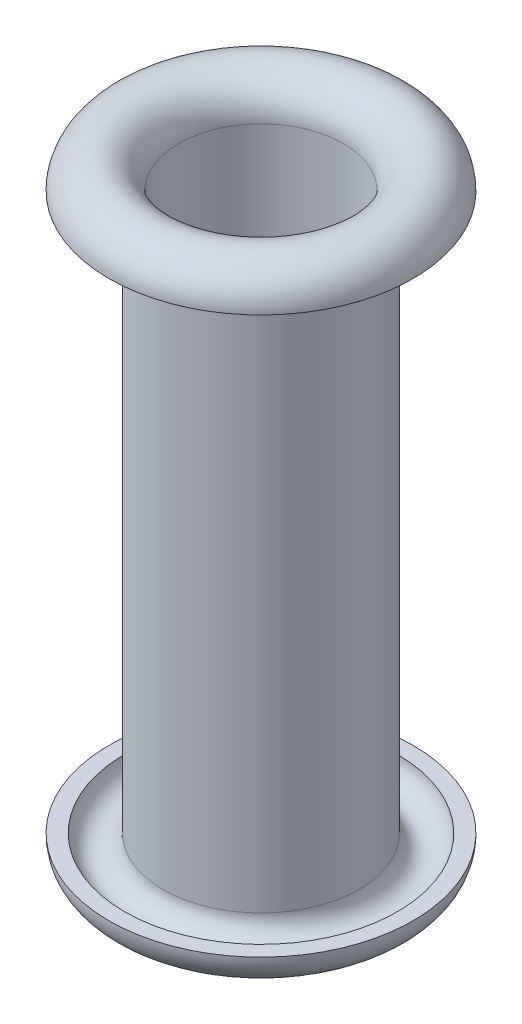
ISO-10303-21;
HEADER;
FILE_DESCRIPTION(('STEP AP214'),'2;1');
FILE_NAME('part.step','',(''),(''),'','','');
FILE_SCHEMA(('AUTOMOTIVE_DESIGN { 1 0 10303 214 1 1 1 1 }'));
ENDSEC;
DATA;
#1=APPLICATION_CONTEXT('core data for automotive mechanical design processes');
#2=APPLICATION_PROTOCOL_DEFINITION('international standard','automotive_design',2000,#1);
#3=PRODUCT_CONTEXT('',#1,'mechanical');
#4=PRODUCT('Part','Part','',(#3));
#5=PRODUCT_RELATED_PRODUCT_CATEGORY('part','',(#4));
#6=PRODUCT_DEFINITION_FORMATION('','',#4);
#7=PRODUCT_DEFINITION_CONTEXT('part definition',#1,'design');
#8=PRODUCT_DEFINITION('design','',#6,#7);
#9=PRODUCT_DEFINITION_SHAPE('','',#8);
#10=(LENGTH_UNIT() NAMED_UNIT(*) SI_UNIT(.MILLI.,.METRE.));
#11=(NAMED_UNIT(*) PLANE_ANGLE_UNIT() SI_UNIT($,.RADIAN.));
#12=(NAMED_UNIT(*) SI_UNIT($,.STERADIAN.) SOLID_ANGLE_UNIT());
#13=UNCERTAINTY_MEASURE_WITH_UNIT(LENGTH_MEASURE(1.E-05),#10,'distance_accuracy_value','');
#14=(GEOMETRIC_REPRESENTATION_CONTEXT(3) GLOBAL_UNCERTAINTY_ASSIGNED_CONTEXT((#13)) GLOBAL_UNIT_ASSIGNED_CONTEXT((#10,
#11,#12)) REPRESENTATION_CONTEXT('',''));
#15=CARTESIAN_POINT('',(0.,0.,0.));
#16=DIRECTION('',(0.,0.,1.));
#17=DIRECTION('',(1.,0.,0.));
#18=AXIS2_PLACEMENT_3D('',#15,#16,#17);
#19=CARTESIAN_POINT('',(0.,1.86608232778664,0.));
#20=DIRECTION('',(0.,-1.,0.));
#21=DIRECTION('',(0.,0.,-1.));
#22=AXIS2_PLACEMENT_3D('',#19,#20,#21);
#23=TOROIDAL_SURFACE('',#22,1.89904377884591,0.565543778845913);
#24=CARTESIAN_POINT('',(0.,1.86608232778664,0.));
#25=DIRECTION('',(0.,-1.,0.));
#26=DIRECTION('',(0.,0.,-1.));
#27=AXIS2_PLACEMENT_3D('',#24,#25,#26);
#28=CIRCLE('',#27,2.46458755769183);
#29=CARTESIAN_POINT('',(0.,1.86608232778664,-2.46458755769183));
#30=VERTEX_POINT('',#29);
#31=EDGE_CURVE('E10',#30,#30,#28,.T.);
#32=ORIENTED_EDGE('',*,*,#31,.T.);
#33=EDGE_LOOP('',(#32));
#34=FACE_BOUND('',#33,.T.);
#35=CARTESIAN_POINT('',(0.,1.86608232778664,0.));
#36=DIRECTION('',(0.,-1.,0.));
#37=DIRECTION('',(0.,0.,-1.));
#38=AXIS2_PLACEMENT_3D('',#35,#36,#37);
#39=CIRCLE('',#38,1.3335);
#40=CARTESIAN_POINT('',(0.,1.86608232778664,-1.3335));
#41=VERTEX_POINT('',#40);
#42=EDGE_CURVE('E59',#41,#41,#39,.T.);
#43=ORIENTED_EDGE('',*,*,#42,.F.);
#44=EDGE_LOOP('',(#43));
#45=FACE_BOUND('',#44,.T.);
#46=ADVANCED_FACE('F31',(#34,#45),#23,.T.);
#47=CARTESIAN_POINT('',(2.21058755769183,1.86608232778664,0.));
#48=DIRECTION('',(0.,1.,0.));
#49=DIRECTION('',(0.,0.,1.));
#50=AXIS2_PLACEMENT_3D('',#47,#48,#49);
#51=PLANE('',#50);
#52=CARTESIAN_POINT('',(0.,1.86608232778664,0.));
#53=DIRECTION('',(0.,-1.,0.));
#54=DIRECTION('',(0.,0.,-1.));
#55=AXIS2_PLACEMENT_3D('',#52,#53,#54);
#56=CIRCLE('',#55,2.21058755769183);
#57=CARTESIAN_POINT('',(0.,1.86608232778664,-2.21058755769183));
#58=VERTEX_POINT('',#57);
#59=EDGE_CURVE('E37',#58,#58,#56,.T.);
#60=ORIENTED_EDGE('',*,*,#59,.T.);
#61=EDGE_LOOP('',(#60));
#62=FACE_BOUND('',#61,.T.);
#63=ORIENTED_EDGE('',*,*,#31,.F.);
#64=EDGE_LOOP('',(#63));
#65=FACE_BOUND('',#64,.T.);
#66=ADVANCED_FACE('F67',(#62,#65),#51,.T.);
#67=CARTESIAN_POINT('',(0.,1.86608232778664,0.));
#68=DIRECTION('',(0.,-1.,0.));
#69=DIRECTION('',(0.,0.,-1.));
#70=AXIS2_PLACEMENT_3D('',#67,#68,#69);
#71=TOROIDAL_SURFACE('',#70,1.89904377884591,0.311543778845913);
#72=CARTESIAN_POINT('',(0.,1.86608232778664,0.));
#73=DIRECTION('',(0.,-1.,0.));
#74=DIRECTION('',(0.,0.,-1.));
#75=AXIS2_PLACEMENT_3D('',#72,#73,#74);
#76=CIRCLE('',#75,1.5875);
#77=CARTESIAN_POINT('',(0.,1.86608232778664,-1.5875));
#78=VERTEX_POINT('',#77);
#79=EDGE_CURVE('E41',#78,#78,#76,.T.);
#80=ORIENTED_EDGE('',*,*,#79,.T.);
#81=EDGE_LOOP('',(#80));
#82=FACE_BOUND('',#81,.T.);
#83=ORIENTED_EDGE('',*,*,#59,.F.);
#84=EDGE_LOOP('',(#83));
#85=FACE_BOUND('',#84,.T.);
#86=ADVANCED_FACE('F71',(#82,#85),#71,.F.);
#87=CARTESIAN_POINT('',(0.,0.,0.));
#88=DIRECTION('',(0.,-1.,0.));
#89=DIRECTION('',(0.,0.,-1.));
#90=AXIS2_PLACEMENT_3D('',#87,#88,#89);
#91=CYLINDRICAL_SURFACE('',#90,1.58750000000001);
#92=CARTESIAN_POINT('',(0.,10.8830823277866,0.));
#93=DIRECTION('',(0.,-1.,0.));
#94=DIRECTION('',(0.,0.,-1.));
#95=AXIS2_PLACEMENT_3D('',#92,#93,#94);
#96=CIRCLE('',#95,1.58750000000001);
#97=CARTESIAN_POINT('',(0.,10.8830823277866,-1.58750000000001));
#98=VERTEX_POINT('',#97);
#99=EDGE_CURVE('E45',#98,#98,#96,.T.);
#100=ORIENTED_EDGE('',*,*,#99,.T.);
#101=EDGE_LOOP('',(#100));
#102=FACE_BOUND('',#101,.T.);
#103=ORIENTED_EDGE('',*,*,#79,.F.);
#104=EDGE_LOOP('',(#103));
#105=FACE_BOUND('',#104,.T.);
#106=ADVANCED_FACE('F75',(#102,#105),#91,.T.);
#107=CARTESIAN_POINT('',(0.,10.8830824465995,0.));
#108=DIRECTION('',(0.,-1.,0.));
#109=DIRECTION('',(0.,0.,-1.));
#110=AXIS2_PLACEMENT_3D('',#107,#108,#109);
#111=TOROIDAL_SURFACE('',#110,1.89904377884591,0.311543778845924);
#112=CARTESIAN_POINT('',(0.,10.8830824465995,0.));
#113=DIRECTION('',(0.,-1.,0.));
#114=DIRECTION('',(0.,0.,-1.));
#115=AXIS2_PLACEMENT_3D('',#112,#113,#114);
#116=CIRCLE('',#115,2.21058755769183);
#117=CARTESIAN_POINT('',(0.,10.8830824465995,-2.21058755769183));
#118=VERTEX_POINT('',#117);
#119=EDGE_CURVE('E50',#118,#118,#116,.T.);
#120=ORIENTED_EDGE('',*,*,#119,.T.);
#121=EDGE_LOOP('',(#120));
#122=FACE_BOUND('',#121,.T.);
#123=ORIENTED_EDGE('',*,*,#99,.F.);
#124=EDGE_LOOP('',(#123));
#125=FACE_BOUND('',#124,.T.);
#126=ADVANCED_FACE('F82',(#122,#125),#111,.F.);
#127=CARTESIAN_POINT('',(2.21058755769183,10.8830824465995,0.));
#128=DIRECTION('',(0.,-1.,0.));
#129=DIRECTION('',(0.,0.,-1.));
#130=AXIS2_PLACEMENT_3D('',#127,#128,#129);
#131=PLANE('',#130);
#132=CARTESIAN_POINT('',(0.,10.8830824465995,0.));
#133=DIRECTION('',(0.,-1.,0.));
#134=DIRECTION('',(0.,0.,-1.));
#135=AXIS2_PLACEMENT_3D('',#132,#133,#134);
#136=CIRCLE('',#135,2.46458755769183);
#137=CARTESIAN_POINT('',(0.,10.8830824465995,-2.46458755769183));
#138=VERTEX_POINT('',#137);
#139=EDGE_CURVE('E53',#138,#138,#136,.T.);
#140=ORIENTED_EDGE('',*,*,#139,.T.);
#141=EDGE_LOOP('',(#140));
#142=FACE_BOUND('',#141,.T.);
#143=ORIENTED_EDGE('',*,*,#119,.F.);
#144=EDGE_LOOP('',(#143));
#145=FACE_BOUND('',#144,.T.);
#146=ADVANCED_FACE('F86',(#142,#145),#131,.T.);
#147=CARTESIAN_POINT('',(0.,10.8830824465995,0.));
#148=DIRECTION('',(0.,-1.,0.));
#149=DIRECTION('',(0.,0.,-1.));
#150=AXIS2_PLACEMENT_3D('',#147,#148,#149);
#151=TOROIDAL_SURFACE('',#150,1.89904377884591,0.565543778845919);
#152=CARTESIAN_POINT('',(0.,10.8830823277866,0.));
#153=DIRECTION('',(0.,-1.,0.));
#154=DIRECTION('',(0.,0.,-1.));
#155=AXIS2_PLACEMENT_3D('',#152,#153,#154);
#156=CIRCLE('',#155,1.3335);
#157=CARTESIAN_POINT('',(0.,10.8830823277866,-1.3335));
#158=VERTEX_POINT('',#157);
#159=EDGE_CURVE('E56',#158,#158,#156,.T.);
#160=ORIENTED_EDGE('',*,*,#159,.T.);
#161=EDGE_LOOP('',(#160));
#162=FACE_BOUND('',#161,.T.);
#163=ORIENTED_EDGE('',*,*,#139,.F.);
#164=EDGE_LOOP('',(#163));
#165=FACE_BOUND('',#164,.T.);
#166=ADVANCED_FACE('F90',(#162,#165),#151,.T.);
#167=CARTESIAN_POINT('',(0.,0.,0.));
#168=DIRECTION('',(0.,-1.,0.));
#169=DIRECTION('',(0.,0.,-1.));
#170=AXIS2_PLACEMENT_3D('',#167,#168,#169);
#171=CYLINDRICAL_SURFACE('',#170,1.3335);
#172=ORIENTED_EDGE('',*,*,#42,.T.);
#173=EDGE_LOOP('',(#172));
#174=FACE_BOUND('',#173,.T.);
#175=ORIENTED_EDGE('',*,*,#159,.F.);
#176=EDGE_LOOP('',(#175));
#177=FACE_BOUND('',#176,.T.);
#178=ADVANCED_FACE('F63',(#174,#177),#171,.F.);
#179=CLOSED_SHELL('',(#46,#66,#86,#106,#126,#146,#166,#178));
#180=MANIFOLD_SOLID_BREP('B2',#179);
#181=ADVANCED_BREP_SHAPE_REPRESENTATION('',(#18,#180),#14);
#182=SHAPE_DEFINITION_REPRESENTATION(#9,#181);
ENDSEC;
END-ISO-10303-21;
